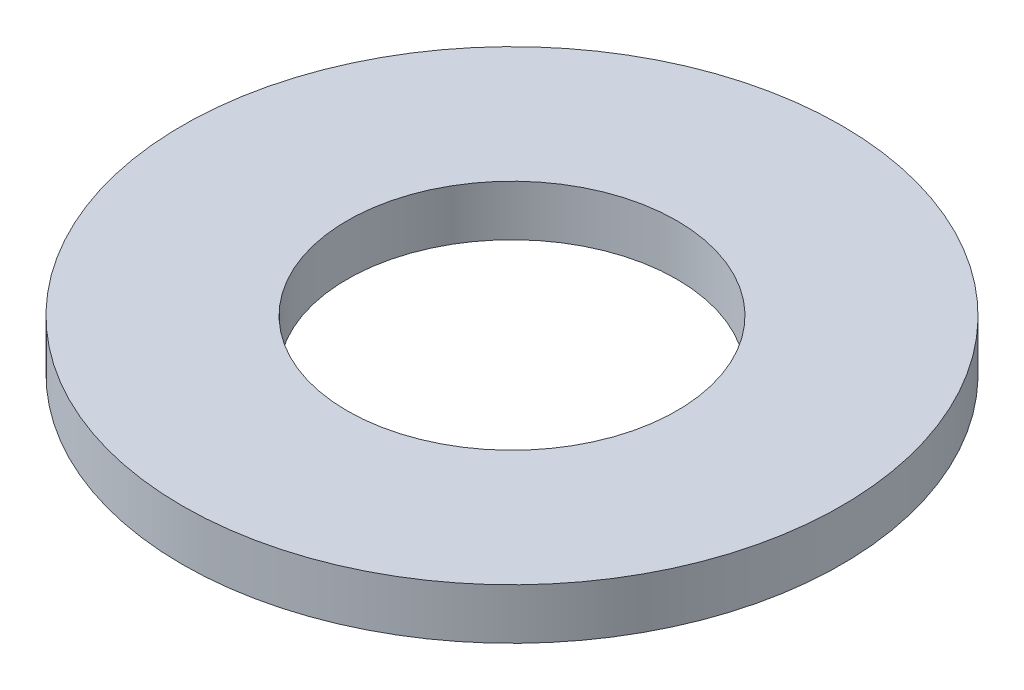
ISO-10303-21;
HEADER;
FILE_DESCRIPTION(('STEP AP214'),'2;1');
FILE_NAME('part.step','',(''),(''),'','','');
FILE_SCHEMA(('AUTOMOTIVE_DESIGN { 1 0 10303 214 1 1 1 1 }'));
ENDSEC;
DATA;
#1=APPLICATION_CONTEXT('core data for automotive mechanical design processes');
#2=APPLICATION_PROTOCOL_DEFINITION('international standard','automotive_design',2000,#1);
#3=PRODUCT_CONTEXT('',#1,'mechanical');
#4=PRODUCT('Part','Part','',(#3));
#5=PRODUCT_RELATED_PRODUCT_CATEGORY('part','',(#4));
#6=PRODUCT_DEFINITION_FORMATION('','',#4);
#7=PRODUCT_DEFINITION_CONTEXT('part definition',#1,'design');
#8=PRODUCT_DEFINITION('design','',#6,#7);
#9=PRODUCT_DEFINITION_SHAPE('','',#8);
#10=(LENGTH_UNIT() NAMED_UNIT(*) SI_UNIT(.MILLI.,.METRE.));
#11=(NAMED_UNIT(*) PLANE_ANGLE_UNIT() SI_UNIT($,.RADIAN.));
#12=(NAMED_UNIT(*) SI_UNIT($,.STERADIAN.) SOLID_ANGLE_UNIT());
#13=UNCERTAINTY_MEASURE_WITH_UNIT(LENGTH_MEASURE(1.E-05),#10,'distance_accuracy_value','');
#14=(GEOMETRIC_REPRESENTATION_CONTEXT(3) GLOBAL_UNCERTAINTY_ASSIGNED_CONTEXT((#13)) GLOBAL_UNIT_ASSIGNED_CONTEXT((#10,
#11,#12)) REPRESENTATION_CONTEXT('',''));
#15=CARTESIAN_POINT('',(0.,0.,0.));
#16=DIRECTION('',(0.,0.,1.));
#17=DIRECTION('',(1.,0.,0.));
#18=AXIS2_PLACEMENT_3D('',#15,#16,#17);
#19=CARTESIAN_POINT('',(0.,0.609599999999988,0.));
#20=DIRECTION('',(0.,-1.,0.));
#21=DIRECTION('',(0.,0.,-1.));
#22=AXIS2_PLACEMENT_3D('',#19,#20,#21);
#23=CYLINDRICAL_SURFACE('',#22,3.9624);
#24=CARTESIAN_POINT('',(0.,0.609599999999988,0.));
#25=DIRECTION('',(0.,1.,0.));
#26=DIRECTION('',(0.,0.,1.));
#27=AXIS2_PLACEMENT_3D('',#24,#25,#26);
#28=CIRCLE('',#27,3.9624);
#29=CARTESIAN_POINT('',(0.,0.609599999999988,3.9624));
#30=VERTEX_POINT('',#29);
#31=EDGE_CURVE('E10',#30,#30,#28,.T.);
#32=ORIENTED_EDGE('',*,*,#31,.F.);
#33=EDGE_LOOP('',(#32));
#34=FACE_BOUND('',#33,.T.);
#35=CARTESIAN_POINT('',(0.,0.,0.));
#36=DIRECTION('',(0.,1.,0.));
#37=DIRECTION('',(0.,0.,1.));
#38=AXIS2_PLACEMENT_3D('',#35,#36,#37);
#39=CIRCLE('',#38,3.9624);
#40=CARTESIAN_POINT('',(0.,0.,3.9624));
#41=VERTEX_POINT('',#40);
#42=EDGE_CURVE('E46',#41,#41,#39,.T.);
#43=ORIENTED_EDGE('',*,*,#42,.T.);
#44=EDGE_LOOP('',(#43));
#45=FACE_BOUND('',#44,.T.);
#46=ADVANCED_FACE('F43',(#34,#45),#23,.T.);
#47=CARTESIAN_POINT('',(0.,0.609599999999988,0.));
#48=DIRECTION('',(0.,1.,0.));
#49=DIRECTION('',(0.,0.,1.));
#50=AXIS2_PLACEMENT_3D('',#47,#48,#49);
#51=PLANE('',#50);
#52=CARTESIAN_POINT('',(0.,0.609599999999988,0.));
#53=DIRECTION('',(0.,1.,0.));
#54=DIRECTION('',(0.,0.,1.));
#55=AXIS2_PLACEMENT_3D('',#52,#53,#54);
#56=CIRCLE('',#55,1.9812);
#57=CARTESIAN_POINT('',(0.,0.609599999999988,1.9812));
#58=VERTEX_POINT('',#57);
#59=EDGE_CURVE('E58',#58,#58,#56,.T.);
#60=ORIENTED_EDGE('',*,*,#59,.F.);
#61=EDGE_LOOP('',(#60));
#62=FACE_BOUND('',#61,.T.);
#63=ORIENTED_EDGE('',*,*,#31,.T.);
#64=EDGE_LOOP('',(#63));
#65=FACE_BOUND('',#64,.T.);
#66=ADVANCED_FACE('F76',(#62,#65),#51,.T.);
#67=CARTESIAN_POINT('',(0.,0.,0.));
#68=DIRECTION('',(0.,1.,0.));
#69=DIRECTION('',(0.,0.,1.));
#70=AXIS2_PLACEMENT_3D('',#67,#68,#69);
#71=PLANE('',#70);
#72=CARTESIAN_POINT('',(0.,0.,0.));
#73=DIRECTION('',(0.,1.,0.));
#74=DIRECTION('',(0.,0.,1.));
#75=AXIS2_PLACEMENT_3D('',#72,#73,#74);
#76=CIRCLE('',#75,1.9812);
#77=CARTESIAN_POINT('',(0.,0.,1.9812));
#78=VERTEX_POINT('',#77);
#79=EDGE_CURVE('E56',#78,#78,#76,.T.);
#80=ORIENTED_EDGE('',*,*,#79,.T.);
#81=EDGE_LOOP('',(#80));
#82=FACE_BOUND('',#81,.T.);
#83=ORIENTED_EDGE('',*,*,#42,.F.);
#84=EDGE_LOOP('',(#83));
#85=FACE_BOUND('',#84,.T.);
#86=ADVANCED_FACE('F67',(#82,#85),#71,.F.);
#87=CARTESIAN_POINT('',(0.,0.,0.));
#88=DIRECTION('',(0.,1.,0.));
#89=DIRECTION('',(0.,0.,1.));
#90=AXIS2_PLACEMENT_3D('',#87,#88,#89);
#91=CYLINDRICAL_SURFACE('',#90,1.9812);
#92=ORIENTED_EDGE('',*,*,#79,.F.);
#93=EDGE_LOOP('',(#92));
#94=FACE_BOUND('',#93,.T.);
#95=ORIENTED_EDGE('',*,*,#59,.T.);
#96=EDGE_LOOP('',(#95));
#97=FACE_BOUND('',#96,.T.);
#98=ADVANCED_FACE('F70',(#94,#97),#91,.F.);
#99=CLOSED_SHELL('',(#46,#66,#86,#98));
#100=MANIFOLD_SOLID_BREP('B2',#99);
#101=ADVANCED_BREP_SHAPE_REPRESENTATION('',(#18,#100),#14);
#102=SHAPE_DEFINITION_REPRESENTATION(#9,#101);
ENDSEC;
END-ISO-10303-21;
